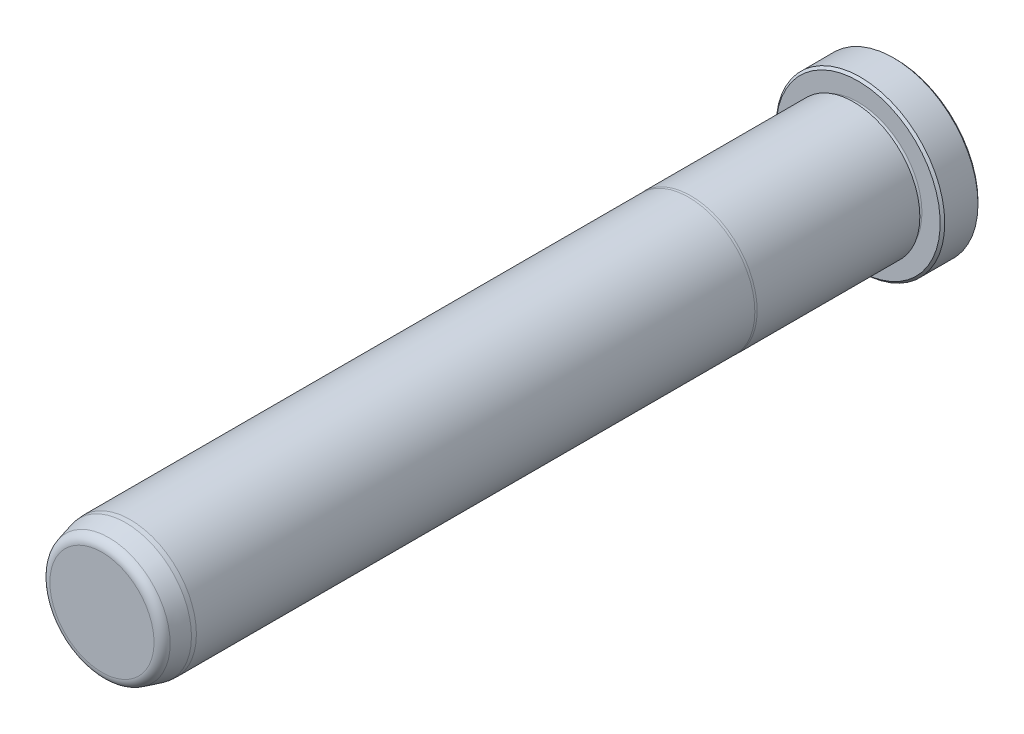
from build123d import *

# Parameters (mm, degrees)
FILLET6_R     = 1.5875
CHAMFER1_SIZE = 0.381


with BuildPart() as part:
    # Sketch1 → Revolve1 (revolve)
    with BuildSketch(Plane(origin=(0, 0, 0), x_dir=(0, 0, -1), z_dir=(1, 0, 0)), mode=Mode.PRIVATE) as revolve1_sk:
        with BuildLine():
            Line((0, 0), (0, 14.1605))
            Line((0, 14.1605), (-6.35, 14.1605))
            Line((-6.35, 14.1605), (-6.35, 10.7188))
            ThreePointArc((-6.35, 10.7188), (-6.731, 10.3378), (-7.112, 10.7188))
            Line((-7.112, 10.7188), (-7.112, 11.1252))
            Line((-7.112, 11.1252), (-34.434763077, 11.1252))
            Line((-34.434763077, 11.1252), (-34.798, 11.0998))
            Line((-34.798, 11.0998), (-128.5875, 11.0998))
            Line((-128.5875, 11.0998), (-129.3495, 11.033133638))
            Line((-129.3495, 11.033133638), (-133.35, 9.961202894))
            Line((-133.35, 9.961202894), (-133.35, 0))
            Line((-133.35, 0), (0, 0))
        make_face()
    revolve(revolve1_sk.sketch.rotate(Axis((0, 0, 0), (0, 0, -1)), 90), axis=Axis((0, 0, 0), (0, 0, -1)))

    # Fillet6
    fillet6_edges = [part.edges().sort_by_distance(p)[0] for p in [
        (-9.961202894, 0, 133.35),
    ]]
    fillet(fillet6_edges, radius=FILLET6_R)

    # Chamfer1
    chamfer1_edges = [part.edges().sort_by_distance(p)[0] for p in [
        (-14.1605, 0, 6.35),
        (-14.1605, 0, 0),
    ]]
    chamfer(chamfer1_edges, length=CHAMFER1_SIZE)


solid = part.part
